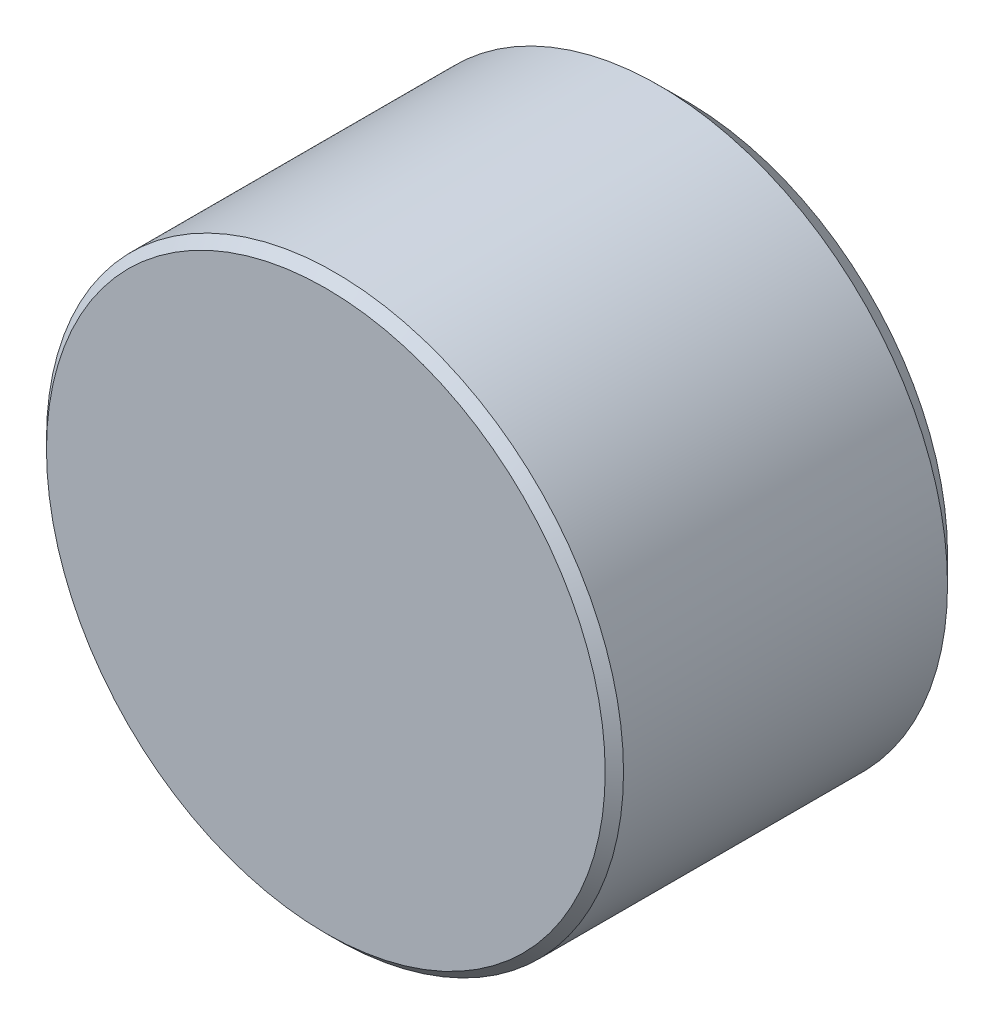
ISO-10303-21;
HEADER;
FILE_DESCRIPTION(('STEP AP214'),'2;1');
FILE_NAME('part.step','',(''),(''),'','','');
FILE_SCHEMA(('AUTOMOTIVE_DESIGN { 1 0 10303 214 1 1 1 1 }'));
ENDSEC;
DATA;
#1=APPLICATION_CONTEXT('core data for automotive mechanical design processes');
#2=APPLICATION_PROTOCOL_DEFINITION('international standard','automotive_design',2000,#1);
#3=PRODUCT_CONTEXT('',#1,'mechanical');
#4=PRODUCT('Part','Part','',(#3));
#5=PRODUCT_RELATED_PRODUCT_CATEGORY('part','',(#4));
#6=PRODUCT_DEFINITION_FORMATION('','',#4);
#7=PRODUCT_DEFINITION_CONTEXT('part definition',#1,'design');
#8=PRODUCT_DEFINITION('design','',#6,#7);
#9=PRODUCT_DEFINITION_SHAPE('','',#8);
#10=(LENGTH_UNIT() NAMED_UNIT(*) SI_UNIT(.MILLI.,.METRE.));
#11=(NAMED_UNIT(*) PLANE_ANGLE_UNIT() SI_UNIT($,.RADIAN.));
#12=(NAMED_UNIT(*) SI_UNIT($,.STERADIAN.) SOLID_ANGLE_UNIT());
#13=UNCERTAINTY_MEASURE_WITH_UNIT(LENGTH_MEASURE(1.E-05),#10,'distance_accuracy_value','');
#14=(GEOMETRIC_REPRESENTATION_CONTEXT(3) GLOBAL_UNCERTAINTY_ASSIGNED_CONTEXT((#13)) GLOBAL_UNIT_ASSIGNED_CONTEXT((#10,
#11,#12)) REPRESENTATION_CONTEXT('',''));
#15=CARTESIAN_POINT('',(0.,0.,0.));
#16=DIRECTION('',(0.,0.,1.));
#17=DIRECTION('',(1.,0.,0.));
#18=AXIS2_PLACEMENT_3D('',#15,#16,#17);
#19=CARTESIAN_POINT('',(0.,0.,0.));
#20=DIRECTION('',(0.,0.,1.));
#21=DIRECTION('',(1.,0.,0.));
#22=AXIS2_PLACEMENT_3D('',#19,#20,#21);
#23=PLANE('',#22);
#24=CARTESIAN_POINT('',(0.,0.,0.));
#25=DIRECTION('',(0.,0.,-1.));
#26=DIRECTION('',(-1.,0.,0.));
#27=AXIS2_PLACEMENT_3D('',#24,#25,#26);
#28=CIRCLE('',#27,3.);
#29=CARTESIAN_POINT('',(-3.,0.,0.));
#30=VERTEX_POINT('',#29);
#31=EDGE_CURVE('E33',#30,#30,#28,.T.);
#32=ORIENTED_EDGE('',*,*,#31,.F.);
#33=EDGE_LOOP('',(#32));
#34=FACE_BOUND('',#33,.T.);
#35=CARTESIAN_POINT('',(0.,0.,0.));
#36=DIRECTION('',(0.,0.,1.));
#37=DIRECTION('',(1.,0.,0.));
#38=AXIS2_PLACEMENT_3D('',#35,#36,#37);
#39=CIRCLE('',#38,7.238);
#40=CARTESIAN_POINT('',(7.238,0.,0.));
#41=VERTEX_POINT('',#40);
#42=EDGE_CURVE('E23',#41,#41,#39,.F.);
#43=ORIENTED_EDGE('',*,*,#42,.T.);
#44=EDGE_LOOP('',(#43));
#45=FACE_BOUND('',#44,.T.);
#46=ADVANCED_FACE('F12',(#34,#45),#23,.F.);
#47=CARTESIAN_POINT('',(0.,0.,10.));
#48=DIRECTION('',(0.,0.,-1.));
#49=DIRECTION('',(-1.,0.,0.));
#50=AXIS2_PLACEMENT_3D('',#47,#48,#49);
#51=CYLINDRICAL_SURFACE('',#50,8.);
#52=CARTESIAN_POINT('',(0.,0.,9.746));
#53=DIRECTION('',(0.,0.,1.));
#54=DIRECTION('',(1.,0.,0.));
#55=AXIS2_PLACEMENT_3D('',#52,#53,#54);
#56=CIRCLE('',#55,8.);
#57=CARTESIAN_POINT('',(8.,0.,9.746));
#58=VERTEX_POINT('',#57);
#59=EDGE_CURVE('E8',#58,#58,#56,.F.);
#60=ORIENTED_EDGE('',*,*,#59,.T.);
#61=EDGE_LOOP('',(#60));
#62=FACE_BOUND('',#61,.T.);
#63=CARTESIAN_POINT('',(0.,0.,0.762));
#64=DIRECTION('',(0.,0.,1.));
#65=DIRECTION('',(1.,0.,0.));
#66=AXIS2_PLACEMENT_3D('',#63,#64,#65);
#67=CIRCLE('',#66,8.);
#68=CARTESIAN_POINT('',(8.,0.,0.762));
#69=VERTEX_POINT('',#68);
#70=EDGE_CURVE('E27',#69,#69,#67,.T.);
#71=ORIENTED_EDGE('',*,*,#70,.T.);
#72=EDGE_LOOP('',(#71));
#73=FACE_BOUND('',#72,.T.);
#74=ADVANCED_FACE('F49',(#62,#73),#51,.T.);
#75=CARTESIAN_POINT('',(0.,0.,10.));
#76=DIRECTION('',(0.,0.,1.));
#77=DIRECTION('',(1.,0.,0.));
#78=AXIS2_PLACEMENT_3D('',#75,#76,#77);
#79=PLANE('',#78);
#80=CARTESIAN_POINT('',(0.,0.,10.));
#81=DIRECTION('',(0.,0.,1.));
#82=DIRECTION('',(1.,0.,0.));
#83=AXIS2_PLACEMENT_3D('',#80,#81,#82);
#84=CIRCLE('',#83,7.746);
#85=CARTESIAN_POINT('',(7.746,0.,10.));
#86=VERTEX_POINT('',#85);
#87=EDGE_CURVE('E19',#86,#86,#84,.T.);
#88=ORIENTED_EDGE('',*,*,#87,.T.);
#89=EDGE_LOOP('',(#88));
#90=FACE_BOUND('',#89,.T.);
#91=ADVANCED_FACE('F56',(#90),#79,.T.);
#92=CARTESIAN_POINT('',(0.,0.,0.762));
#93=DIRECTION('',(0.,0.,1.));
#94=DIRECTION('',(1.,0.,0.));
#95=AXIS2_PLACEMENT_3D('',#92,#93,#94);
#96=CONICAL_SURFACE('',#95,8.,0.785398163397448);
#97=ORIENTED_EDGE('',*,*,#42,.F.);
#98=EDGE_LOOP('',(#97));
#99=FACE_BOUND('',#98,.T.);
#100=ORIENTED_EDGE('',*,*,#70,.F.);
#101=EDGE_LOOP('',(#100));
#102=FACE_BOUND('',#101,.T.);
#103=ADVANCED_FACE('F53',(#99,#102),#96,.T.);
#104=CARTESIAN_POINT('',(0.,0.,10.));
#105=DIRECTION('',(0.,0.,-1.));
#106=DIRECTION('',(-1.,0.,0.));
#107=AXIS2_PLACEMENT_3D('',#104,#105,#106);
#108=CONICAL_SURFACE('',#107,7.746,0.785398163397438);
#109=ORIENTED_EDGE('',*,*,#59,.F.);
#110=EDGE_LOOP('',(#109));
#111=FACE_BOUND('',#110,.T.);
#112=ORIENTED_EDGE('',*,*,#87,.F.);
#113=EDGE_LOOP('',(#112));
#114=FACE_BOUND('',#113,.T.);
#115=ADVANCED_FACE('F14',(#111,#114),#108,.T.);
#116=CARTESIAN_POINT('',(0.,0.,5.));
#117=DIRECTION('',(0.,0.,-1.));
#118=DIRECTION('',(-1.,0.,0.));
#119=AXIS2_PLACEMENT_3D('',#116,#117,#118);
#120=CYLINDRICAL_SURFACE('',#119,3.);
#121=CARTESIAN_POINT('',(0.,0.,5.));
#122=DIRECTION('',(0.,0.,-1.));
#123=DIRECTION('',(-1.,0.,0.));
#124=AXIS2_PLACEMENT_3D('',#121,#122,#123);
#125=CIRCLE('',#124,3.);
#126=CARTESIAN_POINT('',(-3.,0.,5.));
#127=VERTEX_POINT('',#126);
#128=EDGE_CURVE('E32',#127,#127,#125,.T.);
#129=ORIENTED_EDGE('',*,*,#128,.F.);
#130=EDGE_LOOP('',(#129));
#131=FACE_BOUND('',#130,.T.);
#132=ORIENTED_EDGE('',*,*,#31,.T.);
#133=EDGE_LOOP('',(#132));
#134=FACE_BOUND('',#133,.T.);
#135=ADVANCED_FACE('F41',(#131,#134),#120,.F.);
#136=CARTESIAN_POINT('',(0.,0.,5.));
#137=DIRECTION('',(0.,0.,-1.));
#138=DIRECTION('',(-1.,0.,0.));
#139=AXIS2_PLACEMENT_3D('',#136,#137,#138);
#140=PLANE('',#139);
#141=ORIENTED_EDGE('',*,*,#128,.T.);
#142=EDGE_LOOP('',(#141));
#143=FACE_BOUND('',#142,.T.);
#144=ADVANCED_FACE('F39',(#143),#140,.T.);
#145=CLOSED_SHELL('',(#46,#74,#91,#103,#115,#135,#144));
#146=MANIFOLD_SOLID_BREP('B1',#145);
#147=ADVANCED_BREP_SHAPE_REPRESENTATION('',(#18,#146),#14);
#148=SHAPE_DEFINITION_REPRESENTATION(#9,#147);
ENDSEC;
END-ISO-10303-21;
